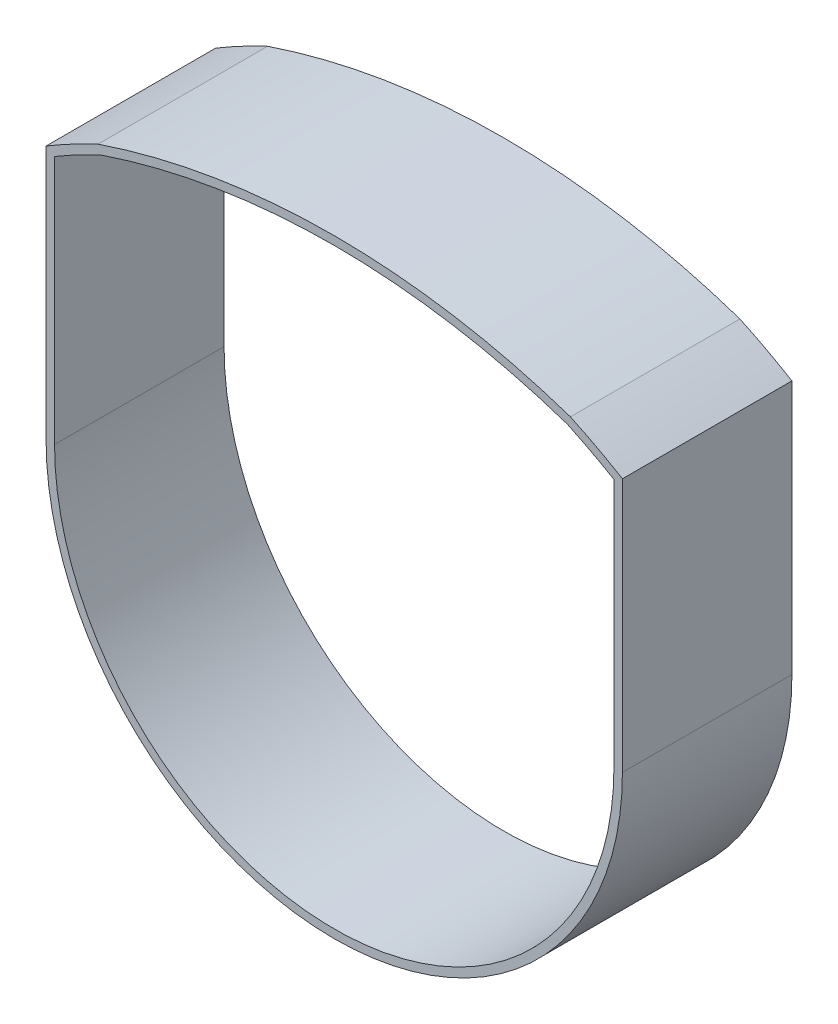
from build123d import *

# Parameters (mm, degrees)
EXTRUSION1_DEPTH      = 10
EXTRUSION1_DEPTH_BACK = 10


with BuildPart() as part:
    # Esquisse1 → Extrusion1 (new, two sides: drawn at the far end of the back side and taken through both)
    with BuildSketch(Plane.XY.offset(-EXTRUSION1_DEPTH_BACK)):
        with BuildLine():
            Line((34, -58.5), (34, -28.5))
            ThreePointArc((34, -28.5), (30.974969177, -26.788603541), (27.8640412, -25.23882406))
            ThreePointArc((27.8640412, -25.23882406), (0, -20.656026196), (-27.8640412, -25.23882406))
            ThreePointArc((-27.8640412, -25.23882406), (-30.974969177, -26.788603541), (-34, -28.5))
            Line((-34, -28.5), (-34, -58.5))
            ThreePointArc((-34, -58.5), (0, -92.5), (34, -58.5))
        make_face()
        with BuildLine():
            Line((33, -58.5), (33, -29.068542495))
            ThreePointArc((33, -29.068542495), (30.28055447, -27.552561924), (27.491635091, -26.168542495))
            ThreePointArc((27.491635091, -26.168542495), (0, -21.656026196), (-27.491635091, -26.168542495))
            ThreePointArc((-27.491635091, -26.168542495), (-30.28055447, -27.552561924), (-33, -29.068542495))
            Line((-33, -29.068542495), (-33, -58.5))
            ThreePointArc((-33, -58.5), (0, -91.5), (33, -58.5))
        make_face(mode=Mode.SUBTRACT)
    extrude(amount=EXTRUSION1_DEPTH + EXTRUSION1_DEPTH_BACK)


solid = part.part
